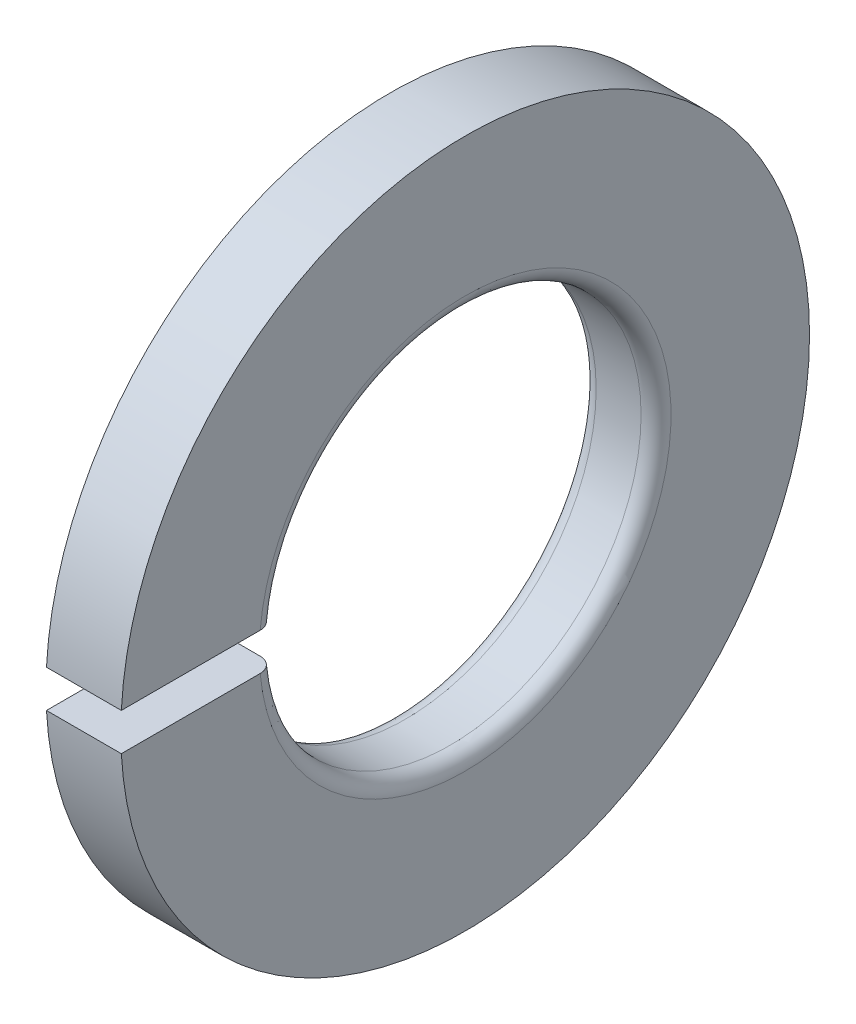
ISO-10303-21;
HEADER;
FILE_DESCRIPTION(('STEP AP214'),'2;1');
FILE_NAME('part.step','',(''),(''),'','','');
FILE_SCHEMA(('AUTOMOTIVE_DESIGN { 1 0 10303 214 1 1 1 1 }'));
ENDSEC;
DATA;
#1=APPLICATION_CONTEXT('core data for automotive mechanical design processes');
#2=APPLICATION_PROTOCOL_DEFINITION('international standard','automotive_design',2000,#1);
#3=PRODUCT_CONTEXT('',#1,'mechanical');
#4=PRODUCT('Part','Part','',(#3));
#5=PRODUCT_RELATED_PRODUCT_CATEGORY('part','',(#4));
#6=PRODUCT_DEFINITION_FORMATION('','',#4);
#7=PRODUCT_DEFINITION_CONTEXT('part definition',#1,'design');
#8=PRODUCT_DEFINITION('design','',#6,#7);
#9=PRODUCT_DEFINITION_SHAPE('','',#8);
#10=(LENGTH_UNIT() NAMED_UNIT(*) SI_UNIT(.MILLI.,.METRE.));
#11=(NAMED_UNIT(*) PLANE_ANGLE_UNIT() SI_UNIT($,.RADIAN.));
#12=(NAMED_UNIT(*) SI_UNIT($,.STERADIAN.) SOLID_ANGLE_UNIT());
#13=UNCERTAINTY_MEASURE_WITH_UNIT(LENGTH_MEASURE(1.E-05),#10,'distance_accuracy_value','');
#14=(GEOMETRIC_REPRESENTATION_CONTEXT(3) GLOBAL_UNCERTAINTY_ASSIGNED_CONTEXT((#13)) GLOBAL_UNIT_ASSIGNED_CONTEXT((#10,
#11,#12)) REPRESENTATION_CONTEXT('',''));
#15=CARTESIAN_POINT('',(0.,0.,0.));
#16=DIRECTION('',(0.,0.,1.));
#17=DIRECTION('',(1.,0.,0.));
#18=AXIS2_PLACEMENT_3D('',#15,#16,#17);
#19=CARTESIAN_POINT('',(-34.9249999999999,0.,0.));
#20=DIRECTION('',(-1.,0.,0.));
#21=DIRECTION('',(0.,0.,1.));
#22=AXIS2_PLACEMENT_3D('',#19,#20,#21);
#23=CYLINDRICAL_SURFACE('',#22,4.6);
#24=DIRECTION('',(-1.,0.,0.));
#25=VECTOR('',#24,1.);
#26=CARTESIAN_POINT('',(-34.9249999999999,0.25,4.59320149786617));
#27=LINE('',#26,#25);
#28=CARTESIAN_POINT('',(0.,0.25,4.59320149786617));
#29=VERTEX_POINT('',#28);
#30=CARTESIAN_POINT('',(-1.,0.25,4.59320149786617));
#31=VERTEX_POINT('',#30);
#32=EDGE_CURVE('E43',#29,#31,#27,.T.);
#33=ORIENTED_EDGE('',*,*,#32,.F.);
#34=CARTESIAN_POINT('',(0.,0.,0.));
#35=DIRECTION('',(-1.,0.,0.));
#36=DIRECTION('',(0.,0.,1.));
#37=AXIS2_PLACEMENT_3D('',#34,#35,#36);
#38=CIRCLE('',#37,4.6);
#39=CARTESIAN_POINT('',(0.,-0.25,4.59320149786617));
#40=VERTEX_POINT('',#39);
#41=EDGE_CURVE('E104',#29,#40,#38,.T.);
#42=ORIENTED_EDGE('',*,*,#41,.T.);
#43=DIRECTION('',(-1.,0.,0.));
#44=VECTOR('',#43,1.);
#45=CARTESIAN_POINT('',(-34.9249999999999,-0.25,4.59320149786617));
#46=LINE('',#45,#44);
#47=CARTESIAN_POINT('',(-1.,-0.25,4.59320149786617));
#48=VERTEX_POINT('',#47);
#49=EDGE_CURVE('E85',#48,#40,#46,.F.);
#50=ORIENTED_EDGE('',*,*,#49,.F.);
#51=CARTESIAN_POINT('',(-1.,0.,0.));
#52=DIRECTION('',(-1.,0.,0.));
#53=DIRECTION('',(0.,0.,1.));
#54=AXIS2_PLACEMENT_3D('',#51,#52,#53);
#55=CIRCLE('',#54,4.6);
#56=EDGE_CURVE('E116',#31,#48,#55,.T.);
#57=ORIENTED_EDGE('',*,*,#56,.F.);
#58=EDGE_LOOP('',(#33,#42,#50,#57));
#59=FACE_BOUND('',#58,.T.);
#60=ADVANCED_FACE('F30',(#59),#23,.T.);
#61=CARTESIAN_POINT('',(0.,2.75,0.));
#62=DIRECTION('',(-1.,0.,0.));
#63=DIRECTION('',(0.,0.,1.));
#64=AXIS2_PLACEMENT_3D('',#61,#62,#63);
#65=PLANE('',#64);
#66=DIRECTION('',(0.,0.,-1.));
#67=VECTOR('',#66,1.);
#68=CARTESIAN_POINT('',(0.,0.25,4.69199999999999));
#69=LINE('',#68,#67);
#70=CARTESIAN_POINT('',(0.,0.25,2.73861278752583));
#71=VERTEX_POINT('',#70);
#72=EDGE_CURVE('E90',#29,#71,#69,.T.);
#73=ORIENTED_EDGE('',*,*,#72,.T.);
#74=CARTESIAN_POINT('',(0.,0.,0.));
#75=DIRECTION('',(-1.,0.,0.));
#76=DIRECTION('',(0.,0.,1.));
#77=AXIS2_PLACEMENT_3D('',#74,#75,#76);
#78=CIRCLE('',#77,2.75);
#79=CARTESIAN_POINT('',(0.,-0.25,2.73861278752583));
#80=VERTEX_POINT('',#79);
#81=EDGE_CURVE('E97',#71,#80,#78,.T.);
#82=ORIENTED_EDGE('',*,*,#81,.T.);
#83=DIRECTION('',(0.,0.,1.));
#84=VECTOR('',#83,1.);
#85=CARTESIAN_POINT('',(0.,-0.25,0.));
#86=LINE('',#85,#84);
#87=EDGE_CURVE('E79',#80,#40,#86,.T.);
#88=ORIENTED_EDGE('',*,*,#87,.T.);
#89=ORIENTED_EDGE('',*,*,#41,.F.);
#90=EDGE_LOOP('',(#73,#82,#88,#89));
#91=FACE_BOUND('',#90,.T.);
#92=ADVANCED_FACE('F103',(#91),#65,.F.);
#93=CARTESIAN_POINT('',(-0.2,0.,0.));
#94=DIRECTION('',(-1.,0.,0.));
#95=DIRECTION('',(0.,0.,1.));
#96=AXIS2_PLACEMENT_3D('',#93,#94,#95);
#97=TOROIDAL_SURFACE('',#96,2.75,0.199999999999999);
#98=ORIENTED_EDGE('',*,*,#81,.F.);
#99=CARTESIAN_POINT('',(-0.160149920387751,0.25,2.54174516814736));
#100=CARTESIAN_POINT('',(-0.171108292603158,0.25,2.53950679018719));
#101=CARTESIAN_POINT('',(-0.182263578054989,0.25,2.5381920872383));
#102=CARTESIAN_POINT('',(-0.204645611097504,0.25,2.53745423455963));
#103=CARTESIAN_POINT('',(-0.215872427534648,0.25,2.53803332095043));
#104=CARTESIAN_POINT('',(-0.238064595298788,0.25,2.5410685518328));
#105=CARTESIAN_POINT('',(-0.249030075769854,0.25,2.54352374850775));
#106=CARTESIAN_POINT('',(-0.27039081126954,0.25,2.55023793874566));
#107=CARTESIAN_POINT('',(-0.280786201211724,0.25,2.55449650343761));
#108=CARTESIAN_POINT('',(-0.300728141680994,0.25,2.56469925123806));
#109=CARTESIAN_POINT('',(-0.310273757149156,0.25,2.57064526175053));
#110=CARTESIAN_POINT('',(-0.328236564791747,0.25,2.58404991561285));
#111=CARTESIAN_POINT('',(-0.336653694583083,0.25,2.59150864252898));
#112=CARTESIAN_POINT('',(-0.352155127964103,0.25,2.60775681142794));
#113=CARTESIAN_POINT('',(-0.359234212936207,0.25,2.61655123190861));
#114=CARTESIAN_POINT('',(-0.371823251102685,0.25,2.6351993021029));
#115=CARTESIAN_POINT('',(-0.377333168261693,0.25,2.64505297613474));
#116=CARTESIAN_POINT('',(-0.386652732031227,0.25,2.66558705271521));
#117=CARTESIAN_POINT('',(-0.390454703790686,0.25,2.67627093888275));
#118=CARTESIAN_POINT('',(-0.396216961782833,0.25,2.69812433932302));
#119=CARTESIAN_POINT('',(-0.398177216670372,0.25,2.70929386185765));
#120=CARTESIAN_POINT('',(-0.400204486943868,0.25,2.73183659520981));
#121=CARTESIAN_POINT('',(-0.400265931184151,0.25,2.74321030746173));
#122=CARTESIAN_POINT('',(-0.398479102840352,0.25,2.76580682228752));
#123=CARTESIAN_POINT('',(-0.396630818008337,0.25,2.77702962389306));
#124=CARTESIAN_POINT('',(-0.391074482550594,0.25,2.79900827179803));
#125=CARTESIAN_POINT('',(-0.387365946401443,0.25,2.8097639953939));
#126=CARTESIAN_POINT('',(-0.378191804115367,0.25,2.83049810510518));
#127=CARTESIAN_POINT('',(-0.372726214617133,0.25,2.84047649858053));
#128=CARTESIAN_POINT('',(-0.360205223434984,0.25,2.8593480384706));
#129=CARTESIAN_POINT('',(-0.353153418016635,0.25,2.86824357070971));
#130=CARTESIAN_POINT('',(-0.33765153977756,0.25,2.88471910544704));
#131=CARTESIAN_POINT('',(-0.329201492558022,0.25,2.89229913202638));
#132=CARTESIAN_POINT('',(-0.311175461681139,0.25,2.90589931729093));
#133=CARTESIAN_POINT('',(-0.301603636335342,0.25,2.91192498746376));
#134=CARTESIAN_POINT('',(-0.281581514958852,0.25,2.92227735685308));
#135=CARTESIAN_POINT('',(-0.271131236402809,0.25,2.92660408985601));
#136=CARTESIAN_POINT('',(-0.24968756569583,0.25,2.93342084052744));
#137=CARTESIAN_POINT('',(-0.238696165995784,0.25,2.93591712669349));
#138=CARTESIAN_POINT('',(-0.216450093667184,0.25,2.93902483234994));
#139=CARTESIAN_POINT('',(-0.205195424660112,0.25,2.93963627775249));
#140=CARTESIAN_POINT('',(-0.182766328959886,0.25,2.93895726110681));
#141=CARTESIAN_POINT('',(-0.171591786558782,0.25,2.93767061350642));
#142=CARTESIAN_POINT('',(-0.149617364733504,0.25,2.93323967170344));
#143=CARTESIAN_POINT('',(-0.138817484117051,0.25,2.93009538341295));
#144=CARTESIAN_POINT('',(-0.117896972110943,0.25,2.92203955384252));
#145=CARTESIAN_POINT('',(-0.107776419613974,0.25,2.91712780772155));
#146=CARTESIAN_POINT('',(-0.0885011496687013,0.25,2.90567848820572));
#147=CARTESIAN_POINT('',(-0.0793464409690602,0.25,2.8991409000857));
#148=CARTESIAN_POINT('',(-0.0622405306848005,0.25,2.88461099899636));
#149=CARTESIAN_POINT('',(-0.0542920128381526,0.25,2.8766155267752));
#150=CARTESIAN_POINT('',(-0.0398444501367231,0.25,2.85940773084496));
#151=CARTESIAN_POINT('',(-0.0333454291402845,0.25,2.85019538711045));
#152=CARTESIAN_POINT('',(-0.0219568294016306,0.25,2.83078090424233));
#153=CARTESIAN_POINT('',(-0.0170729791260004,0.25,2.82057540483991));
#154=CARTESIAN_POINT('',(-0.00908107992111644,0.25,2.79949129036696));
#155=CARTESIAN_POINT('',(-0.00597307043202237,0.25,2.78861266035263));
#156=CARTESIAN_POINT('',(-0.0016103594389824,0.25,2.76645000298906));
#157=CARTESIAN_POINT('',(-0.000362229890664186,0.25,2.75516468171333));
#158=CARTESIAN_POINT('',(0.000225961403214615,0.25,2.73254434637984));
#159=CARTESIAN_POINT('',(-0.000434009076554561,0.25,2.72120933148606));
#160=CARTESIAN_POINT('',(-0.00364666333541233,0.25,2.69878654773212));
#161=CARTESIAN_POINT('',(-0.00620328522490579,0.25,2.68769934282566));
#162=CARTESIAN_POINT('',(-0.0131423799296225,0.25,2.66611217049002));
#163=CARTESIAN_POINT('',(-0.0175247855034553,0.25,2.65561218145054));
#164=CARTESIAN_POINT('',(-0.027989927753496,0.25,2.6355047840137));
#165=CARTESIAN_POINT('',(-0.0340716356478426,0.25,2.62589684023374));
#166=CARTESIAN_POINT('',(-0.0477683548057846,0.25,2.60783997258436));
#167=CARTESIAN_POINT('',(-0.0553837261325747,0.25,2.59939132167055));
#168=CARTESIAN_POINT('',(-0.0719084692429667,0.25,2.58392185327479));
#169=CARTESIAN_POINT('',(-0.0808143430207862,0.25,2.57689729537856));
#170=CARTESIAN_POINT('',(-0.0996768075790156,0.25,2.56445847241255));
#171=CARTESIAN_POINT('',(-0.109632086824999,0.25,2.55904222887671));
#172=CARTESIAN_POINT('',(-0.126414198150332,0.25,2.55167821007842));
#173=CARTESIAN_POINT('',(-0.133010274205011,0.25,2.54919196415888));
#174=CARTESIAN_POINT('',(-0.146428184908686,0.25,2.54493013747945));
#175=CARTESIAN_POINT('',(-0.153250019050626,0.25,2.54315455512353));
#176=CARTESIAN_POINT('',(-0.160149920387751,0.25,2.54174516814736));
#177=B_SPLINE_CURVE_WITH_KNOTS('',3,(#99,#100,#101,#102,#103,#104,#105,#106,#107,#108,#109,#110,
#111,#112,#113,#114,#115,#116,#117,#118,#119,#120,#121,#122,#123,#124,#125,#126,#127,#128,#129,
#130,#131,#132,#133,#134,#135,#136,#137,#138,#139,#140,#141,#142,#143,#144,#145,#146,#147,#148,
#149,#150,#151,#152,#153,#154,#155,#156,#157,#158,#159,#160,#161,#162,#163,#164,#165,#166,#167,
#168,#169,#170,#171,#172,#173,#174,#175,#176),.UNSPECIFIED.,.T.,.F.,(4,2,2,2,2,2,2,2,2,2,2,2,2,
2,2,2,2,2,2,2,2,2,2,2,2,2,2,2,2,2,2,2,2,2,2,2,2,2,4),(0.,0.0335282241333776,0.06709605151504,
0.100646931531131,0.134189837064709,0.167769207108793,0.201350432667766,0.235060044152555,
0.268770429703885,0.302630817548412,0.336491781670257,0.370452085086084,0.404412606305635,
0.438381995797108,0.472351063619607,0.50624387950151,0.540136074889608,0.573906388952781,
0.607676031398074,0.641329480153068,0.674982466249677,0.708567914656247,0.742153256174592,
0.775742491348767,0.809332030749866,0.842995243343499,0.876659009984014,0.910440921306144,
0.944223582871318,0.978125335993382,1.01202766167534,1.04600057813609,1.07997224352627,
1.11392338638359,1.1478825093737,1.18175124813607,1.21557814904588,1.23668912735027,
1.25780005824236),.UNSPECIFIED.);
#178=CARTESIAN_POINT('',(-0.199999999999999,0.25,2.5377155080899));
#179=VERTEX_POINT('',#178);
#180=EDGE_CURVE('E123',#71,#179,#177,.T.);
#181=ORIENTED_EDGE('',*,*,#180,.T.);
#182=CARTESIAN_POINT('',(-0.199999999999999,0.,0.));
#183=DIRECTION('',(-1.,0.,0.));
#184=DIRECTION('',(0.,0.,1.));
#185=AXIS2_PLACEMENT_3D('',#182,#183,#184);
#186=CIRCLE('',#185,2.55);
#187=CARTESIAN_POINT('',(-0.199999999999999,-0.25,2.5377155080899));
#188=VERTEX_POINT('',#187);
#189=EDGE_CURVE('E99',#179,#188,#186,.T.);
#190=ORIENTED_EDGE('',*,*,#189,.T.);
#191=CARTESIAN_POINT('',(-0.160149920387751,-0.25,2.54174516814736));
#192=CARTESIAN_POINT('',(-0.149161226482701,-0.25,2.54399077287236));
#193=CARTESIAN_POINT('',(-0.138354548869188,-0.25,2.54716849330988));
#194=CARTESIAN_POINT('',(-0.117420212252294,-0.25,2.55529814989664));
#195=CARTESIAN_POINT('',(-0.107293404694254,-0.25,2.56025226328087));
#196=CARTESIAN_POINT('',(-0.0880203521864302,-0.25,2.57178651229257));
#197=CARTESIAN_POINT('',(-0.0788734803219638,-0.25,2.57836559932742));
#198=CARTESIAN_POINT('',(-0.061812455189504,-0.25,2.59295982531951));
#199=CARTESIAN_POINT('',(-0.0538980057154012,-0.25,2.60097461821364));
#200=CARTESIAN_POINT('',(-0.0394954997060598,-0.25,2.61824014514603));
#201=CARTESIAN_POINT('',(-0.0330120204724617,-0.25,2.62749469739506));
#202=CARTESIAN_POINT('',(-0.0216827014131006,-0.25,2.64695754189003));
#203=CARTESIAN_POINT('',(-0.0168369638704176,-0.25,2.65716589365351));
#204=CARTESIAN_POINT('',(-0.00890006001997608,-0.25,2.67829332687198));
#205=CARTESIAN_POINT('',(-0.00581649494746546,-0.25,2.68921526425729));
#206=CARTESIAN_POINT('',(-0.00152171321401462,-0.25,2.71142129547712));
#207=CARTESIAN_POINT('',(-0.00031052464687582,-0.25,2.72270539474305));
#208=CARTESIAN_POINT('',(0.000206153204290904,-0.25,2.74534500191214));
#209=CARTESIAN_POINT('',(-0.000493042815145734,-0.25,2.75670061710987));
#210=CARTESIAN_POINT('',(-0.00378842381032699,-0.25,2.77913325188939));
#211=CARTESIAN_POINT('',(-0.00638460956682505,-0.25,2.79021027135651));
#212=CARTESIAN_POINT('',(-0.0134013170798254,-0.25,2.81176720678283));
#213=CARTESIAN_POINT('',(-0.0178213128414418,-0.25,2.82224729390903));
#214=CARTESIAN_POINT('',(-0.0283625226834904,-0.25,2.84231392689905));
#215=CARTESIAN_POINT('',(-0.0344837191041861,-0.25,2.85190048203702));
#216=CARTESIAN_POINT('',(-0.0482371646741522,-0.25,2.86988035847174));
#217=CARTESIAN_POINT('',(-0.0558654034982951,-0.25,2.87827674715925));
#218=CARTESIAN_POINT('',(-0.0724279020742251,-0.25,2.89366382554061));
#219=CARTESIAN_POINT('',(-0.0813621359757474,-0.25,2.90065454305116));
#220=CARTESIAN_POINT('',(-0.100247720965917,-0.25,2.9130044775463));
#221=CARTESIAN_POINT('',(-0.110195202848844,-0.25,2.91836961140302));
#222=CARTESIAN_POINT('',(-0.13085183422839,-0.25,2.92734742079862));
#223=CARTESIAN_POINT('',(-0.141560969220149,-0.25,2.9309601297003));
#224=CARTESIAN_POINT('',(-0.163399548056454,-0.25,2.9363191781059));
#225=CARTESIAN_POINT('',(-0.174527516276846,-0.25,2.93807153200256));
#226=CARTESIAN_POINT('',(-0.196919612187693,-0.25,2.93967978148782));
#227=CARTESIAN_POINT('',(-0.208183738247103,-0.25,2.93953569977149));
#228=CARTESIAN_POINT('',(-0.230509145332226,-0.25,2.93735708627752));
#229=CARTESIAN_POINT('',(-0.241570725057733,-0.25,2.93532561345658));
#230=CARTESIAN_POINT('',(-0.263196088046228,-0.25,2.92943539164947));
#231=CARTESIAN_POINT('',(-0.273759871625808,-0.25,2.92557664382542));
#232=CARTESIAN_POINT('',(-0.294096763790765,-0.25,2.91614054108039));
#233=CARTESIAN_POINT('',(-0.303869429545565,-0.25,2.91056223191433));
#234=CARTESIAN_POINT('',(-0.322342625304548,-0.25,2.89784802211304));
#235=CARTESIAN_POINT('',(-0.331043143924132,-0.25,2.89071210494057));
#236=CARTESIAN_POINT('',(-0.347149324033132,-0.25,2.8750665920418));
#237=CARTESIAN_POINT('',(-0.35455164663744,-0.25,2.86655355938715));
#238=CARTESIAN_POINT('',(-0.367828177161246,-0.25,2.84840941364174));
#239=CARTESIAN_POINT('',(-0.373702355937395,-0.25,2.83877827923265));
#240=CARTESIAN_POINT('',(-0.383778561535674,-0.25,2.81863398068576));
#241=CARTESIAN_POINT('',(-0.387974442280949,-0.25,2.80811774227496));
#242=CARTESIAN_POINT('',(-0.394547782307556,-0.25,2.78653154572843));
#243=CARTESIAN_POINT('',(-0.396925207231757,-0.25,2.77546157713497));
#244=CARTESIAN_POINT('',(-0.399801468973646,-0.25,2.75304242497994));
#245=CARTESIAN_POINT('',(-0.400293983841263,-0.25,2.74169243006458));
#246=CARTESIAN_POINT('',(-0.399369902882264,-0.25,2.71907033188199));
#247=CARTESIAN_POINT('',(-0.397953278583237,-0.25,2.70779822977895));
#248=CARTESIAN_POINT('',(-0.393246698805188,-0.25,2.68563294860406));
#249=CARTESIAN_POINT('',(-0.389953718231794,-0.25,2.67474041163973));
#250=CARTESIAN_POINT('',(-0.381583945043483,-0.25,2.65366354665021));
#251=CARTESIAN_POINT('',(-0.376507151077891,-0.25,2.64347921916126));
#252=CARTESIAN_POINT('',(-0.364717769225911,-0.25,2.62412038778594));
#253=CARTESIAN_POINT('',(-0.358006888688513,-0.25,2.61494484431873));
#254=CARTESIAN_POINT('',(-0.343135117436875,-0.25,2.59785606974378));
#255=CARTESIAN_POINT('',(-0.334974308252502,-0.25,2.58994276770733));
#256=CARTESIAN_POINT('',(-0.317465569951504,-0.25,2.57563430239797));
#257=CARTESIAN_POINT('',(-0.308122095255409,-0.25,2.56923368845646));
#258=CARTESIAN_POINT('',(-0.288486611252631,-0.25,2.55809873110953));
#259=CARTESIAN_POINT('',(-0.278194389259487,-0.25,2.55336476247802));
#260=CARTESIAN_POINT('',(-0.25700201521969,-0.25,2.54571994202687));
#261=CARTESIAN_POINT('',(-0.246104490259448,-0.25,2.54280179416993));
#262=CARTESIAN_POINT('',(-0.223982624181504,-0.25,2.53884726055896));
#263=CARTESIAN_POINT('',(-0.212758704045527,-0.25,2.53780855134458));
#264=CARTESIAN_POINT('',(-0.194591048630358,-0.25,2.53766752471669));
#265=CARTESIAN_POINT('',(-0.18764669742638,-0.25,2.53797799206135));
#266=CARTESIAN_POINT('',(-0.173828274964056,-0.25,2.53932156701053));
#267=CARTESIAN_POINT('',(-0.166954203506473,-0.25,2.54035467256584));
#268=CARTESIAN_POINT('',(-0.160149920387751,-0.25,2.54174516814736));
#269=B_SPLINE_CURVE_WITH_KNOTS('',3,(#191,#192,#193,#194,#195,#196,#197,#198,#199,#200,#201,
#202,#203,#204,#205,#206,#207,#208,#209,#210,#211,#212,#213,#214,#215,#216,#217,#218,#219,#220,
#221,#222,#223,#224,#225,#226,#227,#228,#229,#230,#231,#232,#233,#234,#235,#236,#237,#238,#239,
#240,#241,#242,#243,#244,#245,#246,#247,#248,#249,#250,#251,#252,#253,#254,#255,#256,#257,#258,
#259,#260,#261,#262,#263,#264,#265,#266,#267,#268),.UNSPECIFIED.,.T.,.F.,(4,2,2,2,2,2,2,2,2,2,2,
2,2,2,2,2,2,2,2,2,2,2,2,2,2,2,2,2,2,2,2,2,2,2,2,2,2,2,4),(0.,0.0336219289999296,
0.0672852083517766,0.100926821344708,0.134560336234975,0.168299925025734,0.202041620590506,
0.235927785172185,0.269814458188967,0.303784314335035,0.337754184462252,0.371714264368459,
0.405673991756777,0.439544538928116,0.473414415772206,0.507159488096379,0.540903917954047,
0.574538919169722,0.60817351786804,0.641753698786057,0.675333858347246,0.708932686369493,
0.742531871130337,0.776216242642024,0.809901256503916,0.843708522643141,0.877516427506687,
0.911437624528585,0.94535932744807,0.979335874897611,1.01331244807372,1.04725367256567,
1.08119298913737,1.11500808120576,1.14883077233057,1.18251666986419,1.21616089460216,
1.23697990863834,1.2577988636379),.UNSPECIFIED.);
#270=EDGE_CURVE('E82',#188,#80,#269,.T.);
#271=ORIENTED_EDGE('',*,*,#270,.T.);
#272=EDGE_LOOP('',(#98,#181,#190,#271));
#273=FACE_BOUND('',#272,.T.);
#274=ADVANCED_FACE('F95',(#273),#97,.T.);
#275=CARTESIAN_POINT('',(-34.9249999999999,0.,0.));
#276=DIRECTION('',(-1.,0.,0.));
#277=DIRECTION('',(0.,0.,1.));
#278=AXIS2_PLACEMENT_3D('',#275,#276,#277);
#279=CYLINDRICAL_SURFACE('',#278,2.55);
#280=DIRECTION('',(-1.,0.,0.));
#281=VECTOR('',#280,1.);
#282=CARTESIAN_POINT('',(-34.9249999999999,0.25,2.5377155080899));
#283=LINE('',#282,#281);
#284=CARTESIAN_POINT('',(-0.799999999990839,0.25,2.53771550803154));
#285=VERTEX_POINT('',#284);
#286=EDGE_CURVE('E131',#285,#179,#283,.F.);
#287=ORIENTED_EDGE('',*,*,#286,.F.);
#288=CARTESIAN_POINT('',(-0.800000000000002,0.,0.));
#289=DIRECTION('',(-1.,0.,0.));
#290=DIRECTION('',(0.,0.,1.));
#291=AXIS2_PLACEMENT_3D('',#288,#289,#290);
#292=CIRCLE('',#291,2.55);
#293=CARTESIAN_POINT('',(-0.800000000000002,-0.25,2.5377155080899));
#294=VERTEX_POINT('',#293);
#295=EDGE_CURVE('E107',#285,#294,#292,.T.);
#296=ORIENTED_EDGE('',*,*,#295,.T.);
#297=DIRECTION('',(-1.,0.,0.));
#298=VECTOR('',#297,1.);
#299=CARTESIAN_POINT('',(-34.9249999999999,-0.25,2.5377155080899));
#300=LINE('',#299,#298);
#301=EDGE_CURVE('E100',#188,#294,#300,.T.);
#302=ORIENTED_EDGE('',*,*,#301,.F.);
#303=ORIENTED_EDGE('',*,*,#189,.F.);
#304=EDGE_LOOP('',(#287,#296,#302,#303));
#305=FACE_BOUND('',#304,.T.);
#306=ADVANCED_FACE('F130',(#305),#279,.F.);
#307=CARTESIAN_POINT('',(-0.799999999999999,0.,0.));
#308=DIRECTION('',(-1.,0.,0.));
#309=DIRECTION('',(0.,0.,1.));
#310=AXIS2_PLACEMENT_3D('',#307,#308,#309);
#311=TOROIDAL_SURFACE('',#310,2.75,0.2);
#312=ORIENTED_EDGE('',*,*,#295,.F.);
#313=CARTESIAN_POINT('',(-0.875296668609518,0.25,2.55250165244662));
#314=CARTESIAN_POINT('',(-0.885703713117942,0.25,2.55675169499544));
#315=CARTESIAN_POINT('',(-0.89575839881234,0.25,2.561886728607));
#316=CARTESIAN_POINT('',(-0.914869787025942,0.25,2.57377848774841));
#317=CARTESIAN_POINT('',(-0.92392522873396,0.25,2.58053722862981));
#318=CARTESIAN_POINT('',(-0.940768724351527,0.25,2.59547380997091));
#319=CARTESIAN_POINT('',(-0.948557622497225,0.25,2.60365069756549));
#320=CARTESIAN_POINT('',(-0.962655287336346,0.25,2.62118992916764));
#321=CARTESIAN_POINT('',(-0.968964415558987,0.25,2.63055198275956));
#322=CARTESIAN_POINT('',(-0.979949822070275,0.25,2.65023138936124));
#323=CARTESIAN_POINT('',(-0.984620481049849,0.25,2.66055187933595));
#324=CARTESIAN_POINT('',(-0.992169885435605,0.25,2.68182914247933));
#325=CARTESIAN_POINT('',(-0.995048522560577,0.25,2.69278595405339));
#326=CARTESIAN_POINT('',(-0.998940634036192,0.25,2.71506507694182));
#327=CARTESIAN_POINT('',(-0.999947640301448,0.25,2.72638851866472));
#328=CARTESIAN_POINT('',(-1.00004837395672,0.25,2.74904397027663));
#329=CARTESIAN_POINT('',(-0.99914208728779,0.25,2.76037598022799));
#330=CARTESIAN_POINT('',(-0.995438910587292,0.25,2.78273807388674));
#331=CARTESIAN_POINT('',(-0.992640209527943,0.25,2.79376785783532));
#332=CARTESIAN_POINT('',(-0.985227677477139,0.25,2.81519972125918));
#333=CARTESIAN_POINT('',(-0.980613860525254,0.25,2.82560180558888));
#334=CARTESIAN_POINT('',(-0.969709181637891,0.25,2.84546329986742));
#335=CARTESIAN_POINT('',(-0.963421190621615,0.25,2.85492428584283));
#336=CARTESIAN_POINT('',(-0.949341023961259,0.25,2.87265166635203));
#337=CARTESIAN_POINT('',(-0.941548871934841,0.25,2.88091807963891));
#338=CARTESIAN_POINT('',(-0.924709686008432,0.25,2.89599134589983));
#339=CARTESIAN_POINT('',(-0.915667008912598,0.25,2.9028030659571));
#340=CARTESIAN_POINT('',(-0.896563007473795,0.25,2.91480516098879));
#341=CARTESIAN_POINT('',(-0.886501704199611,0.25,2.9199955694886));
#342=CARTESIAN_POINT('',(-0.865685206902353,0.25,2.92858840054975));
#343=CARTESIAN_POINT('',(-0.854932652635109,0.25,2.93199721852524));
#344=CARTESIAN_POINT('',(-0.833007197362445,0.25,2.93695628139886));
#345=CARTESIAN_POINT('',(-0.821834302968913,0.25,2.93850655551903));
#346=CARTESIAN_POINT('',(-0.799414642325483,0.25,2.93970199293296));
#347=CARTESIAN_POINT('',(-0.788168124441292,0.25,2.9393518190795));
#348=CARTESIAN_POINT('',(-0.765893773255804,0.25,2.93676736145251));
#349=CARTESIAN_POINT('',(-0.754865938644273,0.25,2.93453308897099));
#350=CARTESIAN_POINT('',(-0.733346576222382,0.25,2.928246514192));
#351=CARTESIAN_POINT('',(-0.722854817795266,0.25,2.92419500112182));
#352=CARTESIAN_POINT('',(-0.702698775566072,0.25,2.91439099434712));
#353=CARTESIAN_POINT('',(-0.693034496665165,0.25,2.90863849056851));
#354=CARTESIAN_POINT('',(-0.674789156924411,0.25,2.89558623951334));
#355=CARTESIAN_POINT('',(-0.666209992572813,0.25,2.88828384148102));
#356=CARTESIAN_POINT('',(-0.650394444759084,0.25,2.87234663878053));
#357=CARTESIAN_POINT('',(-0.643158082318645,0.25,2.86371181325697));
#358=CARTESIAN_POINT('',(-0.630207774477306,0.25,2.84532478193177));
#359=CARTESIAN_POINT('',(-0.624498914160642,0.25,2.83556899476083));
#360=CARTESIAN_POINT('',(-0.614793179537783,0.25,2.81524009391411));
#361=CARTESIAN_POINT('',(-0.610796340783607,0.25,2.80466696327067));
#362=CARTESIAN_POINT('',(-0.604613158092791,0.25,2.78296200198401));
#363=CARTESIAN_POINT('',(-0.602433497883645,0.25,2.7718282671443));
#364=CARTESIAN_POINT('',(-0.599969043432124,0.25,2.74935299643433));
#365=CARTESIAN_POINT('',(-0.599684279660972,0.25,2.73801145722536));
#366=CARTESIAN_POINT('',(-0.601018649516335,0.25,2.71541175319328));
#367=CARTESIAN_POINT('',(-0.602642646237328,0.25,2.70415387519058));
#368=CARTESIAN_POINT('',(-0.607757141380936,0.25,2.68207026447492));
#369=CARTESIAN_POINT('',(-0.611247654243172,0.25,2.67124453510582));
#370=CARTESIAN_POINT('',(-0.619998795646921,0.25,2.65033128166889));
#371=CARTESIAN_POINT('',(-0.625259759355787,0.25,2.64024389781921));
#372=CARTESIAN_POINT('',(-0.637404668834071,0.25,2.62109849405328));
#373=CARTESIAN_POINT('',(-0.644288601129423,0.25,2.61204046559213));
#374=CARTESIAN_POINT('',(-0.659466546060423,0.25,2.59523662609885));
#375=CARTESIAN_POINT('',(-0.667756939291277,0.25,2.5874875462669));
#376=CARTESIAN_POINT('',(-0.68552563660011,0.25,2.57349885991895));
#377=CARTESIAN_POINT('',(-0.695003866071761,0.25,2.56725915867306));
#378=CARTESIAN_POINT('',(-0.714834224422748,0.25,2.55649559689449));
#379=CARTESIAN_POINT('',(-0.725182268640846,0.25,2.55196421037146));
#380=CARTESIAN_POINT('',(-0.746497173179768,0.25,2.54471012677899));
#381=CARTESIAN_POINT('',(-0.757464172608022,0.25,2.54198783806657));
#382=CARTESIAN_POINT('',(-0.779659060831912,0.25,2.53843999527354));
#383=CARTESIAN_POINT('',(-0.790885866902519,0.25,2.53760764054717));
#384=CARTESIAN_POINT('',(-0.813309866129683,0.25,2.53784548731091));
#385=CARTESIAN_POINT('',(-0.824507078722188,0.25,2.53891335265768));
#386=CARTESIAN_POINT('',(-0.842334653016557,0.25,2.54214603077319));
#387=CARTESIAN_POINT('',(-0.849074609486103,0.25,2.54373550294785));
#388=CARTESIAN_POINT('',(-0.862353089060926,0.25,2.54760546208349));
#389=CARTESIAN_POINT('',(-0.868891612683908,0.25,2.54988594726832));
#390=CARTESIAN_POINT('',(-0.875296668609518,0.25,2.55250165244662));
#391=B_SPLINE_CURVE_WITH_KNOTS('',3,(#313,#314,#315,#316,#317,#318,#319,#320,#321,#322,#323,
#324,#325,#326,#327,#328,#329,#330,#331,#332,#333,#334,#335,#336,#337,#338,#339,#340,#341,#342,
#343,#344,#345,#346,#347,#348,#349,#350,#351,#352,#353,#354,#355,#356,#357,#358,#359,#360,#361,
#362,#363,#364,#365,#366,#367,#368,#369,#370,#371,#372,#373,#374,#375,#376,#377,#378,#379,#380,
#381,#382,#383,#384,#385,#386,#387,#388,#389,#390),.UNSPECIFIED.,.T.,.F.,(4,2,2,2,2,2,2,2,2,2,2,
2,2,2,2,2,2,2,2,2,2,2,2,2,2,2,2,2,2,2,2,2,2,2,2,2,2,2,4),(0.,0.0336988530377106,
0.0674397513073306,0.10115806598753,0.134868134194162,0.168692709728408,0.202519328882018,
0.236462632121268,0.270406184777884,0.304382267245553,0.33835808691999,0.372276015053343,
0.406193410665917,0.439995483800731,0.473796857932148,0.507476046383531,0.541154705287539,
0.574750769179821,0.608346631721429,0.641927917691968,0.675509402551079,0.709148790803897,
0.742788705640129,0.776539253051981,0.810290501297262,0.844165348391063,0.878040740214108,
0.912002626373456,0.945964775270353,0.979933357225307,1.01390165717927,1.04778383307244,
1.08166388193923,1.11539287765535,1.14912948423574,1.18274450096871,1.21631821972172,
1.23705836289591,1.25779845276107),.UNSPECIFIED.);
#392=CARTESIAN_POINT('',(-1.,0.25,2.73861278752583));
#393=VERTEX_POINT('',#392);
#394=EDGE_CURVE('E117',#285,#393,#391,.T.);
#395=ORIENTED_EDGE('',*,*,#394,.T.);
#396=CARTESIAN_POINT('',(-1.,0.,0.));
#397=DIRECTION('',(-1.,0.,0.));
#398=DIRECTION('',(0.,0.,1.));
#399=AXIS2_PLACEMENT_3D('',#396,#397,#398);
#400=CIRCLE('',#399,2.75);
#401=CARTESIAN_POINT('',(-1.,-0.25,2.73861278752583));
#402=VERTEX_POINT('',#401);
#403=EDGE_CURVE('E120',#393,#402,#400,.T.);
#404=ORIENTED_EDGE('',*,*,#403,.T.);
#405=CARTESIAN_POINT('',(-0.875296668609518,-0.25,2.55250165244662));
#406=CARTESIAN_POINT('',(-0.86493983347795,-0.25,2.54827319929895));
#407=CARTESIAN_POINT('',(-0.854219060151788,-0.25,2.54491499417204));
#408=CARTESIAN_POINT('',(-0.832357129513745,-0.25,2.54004350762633));
#409=CARTESIAN_POINT('',(-0.821215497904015,-0.25,2.53853237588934));
#410=CARTESIAN_POINT('',(-0.798840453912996,-0.25,2.53740419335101));
#411=CARTESIAN_POINT('',(-0.787607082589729,-0.25,2.53778633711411));
#412=CARTESIAN_POINT('',(-0.765367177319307,-0.25,2.54043199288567));
#413=CARTESIAN_POINT('',(-0.754360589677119,-0.25,2.54269505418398));
#414=CARTESIAN_POINT('',(-0.732885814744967,-0.25,2.54903483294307));
#415=CARTESIAN_POINT('',(-0.72241749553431,-0.25,2.55311110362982));
#416=CARTESIAN_POINT('',(-0.702310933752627,-0.25,2.56295903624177));
#417=CARTESIAN_POINT('',(-0.69267273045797,-0.25,2.56873077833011));
#418=CARTESIAN_POINT('',(-0.674472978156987,-0.25,2.58182023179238));
#419=CARTESIAN_POINT('',(-0.665914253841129,-0.25,2.58914187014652));
#420=CARTESIAN_POINT('',(-0.650140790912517,-0.25,2.60511241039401));
#421=CARTESIAN_POINT('',(-0.642926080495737,-0.25,2.61376134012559));
#422=CARTESIAN_POINT('',(-0.63001159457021,-0.25,2.63218164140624));
#423=CARTESIAN_POINT('',(-0.624318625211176,-0.25,2.64195778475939));
#424=CARTESIAN_POINT('',(-0.614647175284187,-0.25,2.6623242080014));
#425=CARTESIAN_POINT('',(-0.610668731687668,-0.25,2.6729145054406));
#426=CARTESIAN_POINT('',(-0.604523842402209,-0.25,2.6946541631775));
#427=CARTESIAN_POINT('',(-0.602364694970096,-0.25,2.70580558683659));
#428=CARTESIAN_POINT('',(-0.599945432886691,-0.25,2.72831263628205));
#429=CARTESIAN_POINT('',(-0.599685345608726,-0.25,2.73966826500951));
#430=CARTESIAN_POINT('',(-0.601073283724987,-0.25,2.76228297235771));
#431=CARTESIAN_POINT('',(-0.60272474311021,-0.25,2.77354184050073));
#432=CARTESIAN_POINT('',(-0.607896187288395,-0.25,2.79562204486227));
#433=CARTESIAN_POINT('',(-0.611416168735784,-0.25,2.80644338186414));
#434=CARTESIAN_POINT('',(-0.620222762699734,-0.25,2.82732956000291));
#435=CARTESIAN_POINT('',(-0.62550768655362,-0.25,2.83739511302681));
#436=CARTESIAN_POINT('',(-0.637697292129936,-0.25,2.85649246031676));
#437=CARTESIAN_POINT('',(-0.644601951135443,-0.25,2.86552426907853));
#438=CARTESIAN_POINT('',(-0.659813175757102,-0.25,2.88226800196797));
#439=CARTESIAN_POINT('',(-0.668115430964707,-0.25,2.88998384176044));
#440=CARTESIAN_POINT('',(-0.68590165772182,-0.25,2.90390589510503));
#441=CARTESIAN_POINT('',(-0.695385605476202,-0.25,2.91011213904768));
#442=CARTESIAN_POINT('',(-0.715228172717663,-0.25,2.92081464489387));
#443=CARTESIAN_POINT('',(-0.725583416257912,-0.25,2.92531716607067));
#444=CARTESIAN_POINT('',(-0.746904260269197,-0.25,2.93251398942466));
#445=CARTESIAN_POINT('',(-0.757869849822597,-0.25,2.93520832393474));
#446=CARTESIAN_POINT('',(-0.78006564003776,-0.25,2.93870521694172));
#447=CARTESIAN_POINT('',(-0.791294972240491,-0.25,2.93951328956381));
#448=CARTESIAN_POINT('',(-0.813729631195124,-0.25,2.93923041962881));
#449=CARTESIAN_POINT('',(-0.824934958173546,-0.25,2.93813949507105));
#450=CARTESIAN_POINT('',(-0.84699073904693,-0.25,2.93409255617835));
#451=CARTESIAN_POINT('',(-0.857841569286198,-0.25,2.93113859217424));
#452=CARTESIAN_POINT('',(-0.878894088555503,-0.25,2.92345282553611));
#453=CARTESIAN_POINT('',(-0.889095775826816,-0.25,2.91872101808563));
#454=CARTESIAN_POINT('',(-0.908573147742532,-0.25,2.90760960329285));
#455=CARTESIAN_POINT('',(-0.917847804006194,-0.25,2.90122819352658));
#456=CARTESIAN_POINT('',(-0.935198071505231,-0.25,2.88700307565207));
#457=CARTESIAN_POINT('',(-0.943273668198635,-0.25,2.87915934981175));
#458=CARTESIAN_POINT('',(-0.958022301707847,-0.25,2.86220830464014));
#459=CARTESIAN_POINT('',(-0.964691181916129,-0.25,2.85309736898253));
#460=CARTESIAN_POINT('',(-0.976411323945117,-0.25,2.83388855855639));
#461=CARTESIAN_POINT('',(-0.981462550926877,-0.25,2.82379066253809));
#462=CARTESIAN_POINT('',(-0.989823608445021,-0.25,2.8028546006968));
#463=CARTESIAN_POINT('',(-0.993126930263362,-0.25,2.7920138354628));
#464=CARTESIAN_POINT('',(-0.99787286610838,-0.25,2.76993235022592));
#465=CARTESIAN_POINT('',(-0.999315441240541,-0.25,2.7586916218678));
#466=CARTESIAN_POINT('',(-1.00030217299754,-0.25,2.73609252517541));
#467=CARTESIAN_POINT('',(-0.999840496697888,-0.25,2.72473390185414));
#468=CARTESIAN_POINT('',(-0.997018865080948,-0.25,2.70225527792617));
#469=CARTESIAN_POINT('',(-0.99465896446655,-0.25,2.69113527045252));
#470=CARTESIAN_POINT('',(-0.988103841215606,-0.25,2.66943902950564));
#471=CARTESIAN_POINT('',(-0.983906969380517,-0.25,2.65886329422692));
#472=CARTESIAN_POINT('',(-0.973792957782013,-0.25,2.6385654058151));
#473=CARTESIAN_POINT('',(-0.967875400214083,-0.25,2.62884346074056));
#474=CARTESIAN_POINT('',(-0.954496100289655,-0.25,2.61054786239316));
#475=CARTESIAN_POINT('',(-0.947036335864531,-0.25,2.60197276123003));
#476=CARTESIAN_POINT('',(-0.930783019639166,-0.25,2.5862113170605));
#477=CARTESIAN_POINT('',(-0.921991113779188,-0.25,2.57902328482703));
#478=CARTESIAN_POINT('',(-0.906814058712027,-0.25,2.56862616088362));
#479=CARTESIAN_POINT('',(-0.900754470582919,-0.25,2.56493301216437));
#480=CARTESIAN_POINT('',(-0.888277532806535,-0.25,2.55821062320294));
#481=CARTESIAN_POINT('',(-0.88186018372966,-0.25,2.55518138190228));
#482=CARTESIAN_POINT('',(-0.875296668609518,-0.25,2.55250165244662));
#483=B_SPLINE_CURVE_WITH_KNOTS('',3,(#405,#406,#407,#408,#409,#410,#411,#412,#413,#414,#415,
#416,#417,#418,#419,#420,#421,#422,#423,#424,#425,#426,#427,#428,#429,#430,#431,#432,#433,#434,
#435,#436,#437,#438,#439,#440,#441,#442,#443,#444,#445,#446,#447,#448,#449,#450,#451,#452,#453,
#454,#455,#456,#457,#458,#459,#460,#461,#462,#463,#464,#465,#466,#467,#468,#469,#470,#471,#472,
#473,#474,#475,#476,#477,#478,#479,#480,#481,#482),.UNSPECIFIED.,.T.,.F.,(4,2,2,2,2,2,2,2,2,2,2,
2,2,2,2,2,2,2,2,2,2,2,2,2,2,2,2,2,2,2,2,2,2,2,2,2,2,2,4),(0.,0.0335344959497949,
0.0671079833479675,0.100667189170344,0.134218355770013,0.167761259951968,0.201305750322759,
0.234936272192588,0.268567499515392,0.302346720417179,0.336126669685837,0.370041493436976,
0.403956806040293,0.437933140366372,0.471909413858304,0.505853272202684,0.539796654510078,
0.573637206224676,0.607477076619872,0.641191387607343,0.674905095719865,0.708520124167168,
0.742134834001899,0.775712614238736,0.809290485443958,0.842905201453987,0.876520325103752,
0.910233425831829,0.943947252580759,0.977785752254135,1.01162495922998,1.04556789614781,
1.07950985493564,1.11348234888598,1.14746309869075,1.18140053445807,1.21529637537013,
1.23654847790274,1.25780054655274),.UNSPECIFIED.);
#484=EDGE_CURVE('E51',#402,#294,#483,.T.);
#485=ORIENTED_EDGE('',*,*,#484,.T.);
#486=EDGE_LOOP('',(#312,#395,#404,#485));
#487=FACE_BOUND('',#486,.T.);
#488=ADVANCED_FACE('F134',(#487),#311,.T.);
#489=CARTESIAN_POINT('',(-1.,4.6,0.));
#490=DIRECTION('',(1.,0.,0.));
#491=DIRECTION('',(0.,0.,-1.));
#492=AXIS2_PLACEMENT_3D('',#489,#490,#491);
#493=PLANE('',#492);
#494=DIRECTION('',(0.,0.,-1.));
#495=VECTOR('',#494,1.);
#496=CARTESIAN_POINT('',(-1.,0.25,0.));
#497=LINE('',#496,#495);
#498=EDGE_CURVE('E11',#31,#393,#497,.T.);
#499=ORIENTED_EDGE('',*,*,#498,.F.);
#500=ORIENTED_EDGE('',*,*,#56,.T.);
#501=DIRECTION('',(0.,0.,1.));
#502=VECTOR('',#501,1.);
#503=CARTESIAN_POINT('',(-1.,-0.25,0.));
#504=LINE('',#503,#502);
#505=EDGE_CURVE('E37',#402,#48,#504,.T.);
#506=ORIENTED_EDGE('',*,*,#505,.F.);
#507=ORIENTED_EDGE('',*,*,#403,.F.);
#508=EDGE_LOOP('',(#499,#500,#506,#507));
#509=FACE_BOUND('',#508,.T.);
#510=ADVANCED_FACE('F119',(#509),#493,.F.);
#511=CARTESIAN_POINT('',(-1.,-0.25,0.));
#512=DIRECTION('',(0.,1.,0.));
#513=DIRECTION('',(0.,0.,1.));
#514=AXIS2_PLACEMENT_3D('',#511,#512,#513);
#515=PLANE('',#514);
#516=ORIENTED_EDGE('',*,*,#49,.T.);
#517=ORIENTED_EDGE('',*,*,#87,.F.);
#518=ORIENTED_EDGE('',*,*,#270,.F.);
#519=ORIENTED_EDGE('',*,*,#301,.T.);
#520=ORIENTED_EDGE('',*,*,#484,.F.);
#521=ORIENTED_EDGE('',*,*,#505,.T.);
#522=EDGE_LOOP('',(#516,#517,#518,#519,#520,#521));
#523=FACE_BOUND('',#522,.T.);
#524=ADVANCED_FACE('F81',(#523),#515,.T.);
#525=CARTESIAN_POINT('',(-1.,0.25,4.69199999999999));
#526=DIRECTION('',(0.,-1.,0.));
#527=DIRECTION('',(0.,0.,-1.));
#528=AXIS2_PLACEMENT_3D('',#525,#526,#527);
#529=PLANE('',#528);
#530=ORIENTED_EDGE('',*,*,#32,.T.);
#531=ORIENTED_EDGE('',*,*,#498,.T.);
#532=ORIENTED_EDGE('',*,*,#394,.F.);
#533=ORIENTED_EDGE('',*,*,#286,.T.);
#534=ORIENTED_EDGE('',*,*,#180,.F.);
#535=ORIENTED_EDGE('',*,*,#72,.F.);
#536=EDGE_LOOP('',(#530,#531,#532,#533,#534,#535));
#537=FACE_BOUND('',#536,.T.);
#538=ADVANCED_FACE('F148',(#537),#529,.T.);
#539=CLOSED_SHELL('',(#60,#92,#274,#306,#488,#510,#524,#538));
#540=MANIFOLD_SOLID_BREP('B2',#539);
#541=ADVANCED_BREP_SHAPE_REPRESENTATION('',(#18,#540),#14);
#542=SHAPE_DEFINITION_REPRESENTATION(#9,#541);
ENDSEC;
END-ISO-10303-21;
